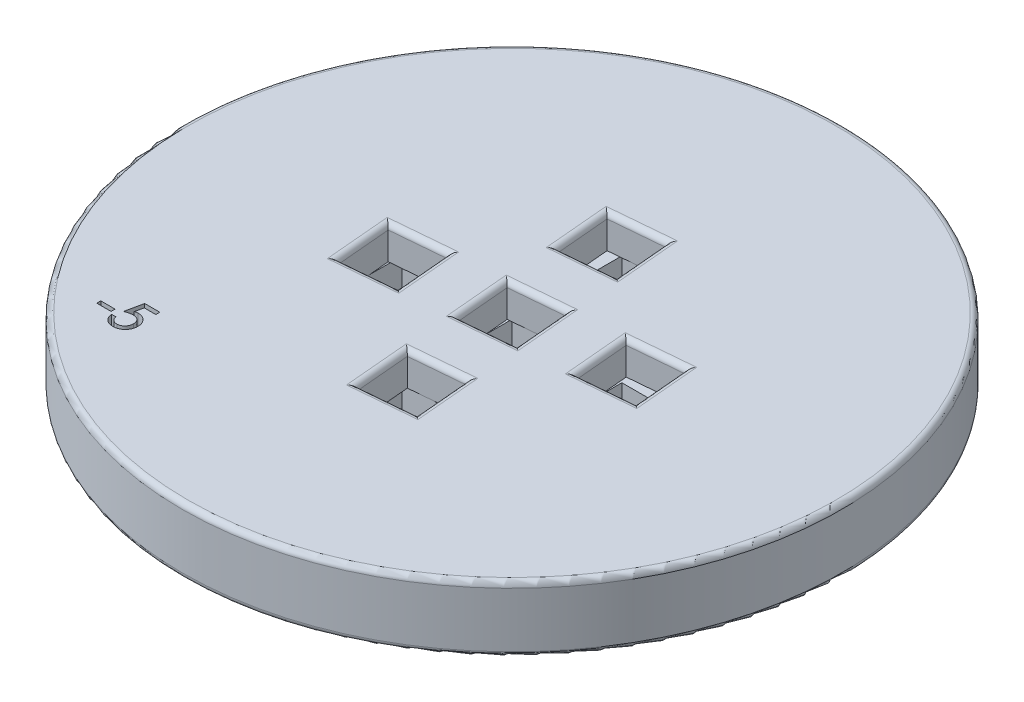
from build123d import *

# Parameters (mm, degrees)
SKETCH1_R           = 30
BOSS_EXTRUDE1_DEPTH = 6
SKETCH4_W           = 5
SKETCH4_H           = 5
CUT_EXTRUDE2_DEPTH  = 3
FILLET2_R           = 0.5
FILLET3_R           = 0.5
SKETCH6_W           = 1.302564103
SKETCH6_H           = 0.366346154
CUT_EXTRUDE3_DEPTH  = 3
FILLET5_R           = 0.5


with BuildPart() as part:
    # Sketch1 → Boss-Extrude1 (new body)
    with BuildSketch(Plane(origin=(0, 0, 0), x_dir=(1, 0, 0), z_dir=(0, 1, 0))):
        with Locations(Location((0, 0, 0), (0, 0, 270))):
            Circle(SKETCH1_R)
    extrude(amount=BOSS_EXTRUDE1_DEPTH)

    # Sketch4 → Cut-Extrude2 (cut)
    with BuildSketch(Plane(origin=(0, 0, 0), x_dir=(-1, 0, 0), z_dir=(0, -1, 0))):
        Rectangle(SKETCH4_W, SKETCH4_H)
        with Locations((0, -10)):
            Rectangle(SKETCH4_W, SKETCH4_H)
        with Locations((10, 0)):
            Rectangle(SKETCH4_W, SKETCH4_H)
        with Locations((-10, 0)):
            Rectangle(SKETCH4_W, SKETCH4_H)
        with Locations((0, 10)):
            Rectangle(SKETCH4_W, SKETCH4_H)
    extrude(amount=-CUT_EXTRUDE2_DEPTH, mode=Mode.SUBTRACT)

    # Fillet2
    fillet2_edges = [part.edges().sort_by_distance(p)[0] for p in [
        (0, 0, -30),
        (-2.5, 0, 10),
        (0, 0, 7.5),
        (2.5, 0, 10),
        (0, 0, 12.5),
        (-12.5, 0, 0),
        (-10, 0, -2.5),
        (-7.5, 0, 0),
        (-10, 0, 2.5),
        (7.5, 0, 0),
        (10, 0, -2.5),
        (12.5, 0, 0),
        (10, 0, 2.5),
        (2.5, 0, -10),
        (0, 0, -7.5),
        (-2.5, 0, -10),
        (0, 0, -12.5),
        (-2.5, 0, 0),
        (0, 0, -2.5),
        (2.5, 0, 0),
        (0, 0, 2.5),
    ]]
    fillet(fillet2_edges, radius=FILLET2_R)

    # Fillet3
    fillet3_edges = [part.edges().sort_by_distance(p)[0] for p in [
        (0, 6, -30),
    ]]
    fillet(fillet3_edges, radius=FILLET3_R)

    # Sketch6 → Cut-Extrude3 (cut)
    with BuildSketch(Plane(origin=(0, 6, 0), x_dir=(1, 0, 0), z_dir=(0, 1, 0))):
        Polygon((-2.272597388, -2.708376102), (2.708376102, -2.272597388), (2.272597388, 2.708376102), (-2.708376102, 2.272597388), align=None)
        Polygon((-3.144154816, 7.253570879), (1.836818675, 7.689349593), (1.401039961, 12.670323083), (-3.57993353, 12.234544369), align=None)
        Polygon((3.57993353, -12.234544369), (-1.401039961, -12.670323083), (-1.836818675, -7.689349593), (3.144154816, -7.253570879), align=None)
        Polygon((12.670323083, -1.401039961), (7.689349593, -1.836818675), (7.253570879, 3.144154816), (12.234544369, 3.57993353), align=None)
        Polygon((-12.234544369, -3.57993353), (-7.253570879, -3.144154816), (-7.689349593, 1.836818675), (-12.670323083, 1.401039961), align=None)
        with Locations((-19.019069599, -17.945677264)):
            Rectangle(SKETCH6_W, SKETCH6_H)
        with BuildLine():
            Line((-16.088300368, -15.971478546), (-16.088300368, -16.3378247))
            Line((-16.088300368, -16.3378247), (-17.131369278, -16.3378247))
            Line((-17.131369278, -16.3378247), (-17.301822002, -17.090233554))
            add(Edge.make_bspline(
                [(-17.301822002, -17.090233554), (-17.281936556, -17.080650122), (-17.241012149, -17.060927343), (-17.172592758, -17.043742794), (-17.098308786, -17.031651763), (-17.046413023, -17.030441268), (-17.019430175, -17.029811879)],
                knots=[0, 0, 0, 0, 0.906577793, 1.865744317, 2.890308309, 4, 4, 4, 4], degree=3))
            add(Edge.make_bspline(
                [(-17.019430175, -17.029811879), (-16.981214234, -17.030511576), (-16.906183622, -17.031885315), (-16.796832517, -17.047236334), (-16.692631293, -17.070234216), (-16.594437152, -17.104542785), (-16.501128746, -17.14677826), (-16.41371837, -17.19962982), (-16.332296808, -17.262200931), (-16.256972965, -17.333426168), (-16.188321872, -17.411007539), (-16.129359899, -17.494787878), (-16.078249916, -17.582319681), (-16.037737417, -17.675115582), (-16.005728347, -17.772215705), (-15.982964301, -17.874025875), (-15.968492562, -17.980241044), (-15.966961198, -18.052692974), (-15.966184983, -18.089417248)],
                knots=[0, 0, 0, 0, 1.094894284, 2.149641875, 3.159658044, 4.149576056, 5.125966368, 6.091225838, 7.071072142, 8.064343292, 9.05924964, 10.03573454, 10.996966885, 11.96032995, 12.932910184, 13.923798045, 14.947619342, 16, 16, 16, 16], degree=3))
            add(Edge.make_bspline(
                [(-15.966184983, -18.089417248), (-15.966781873, -18.11507932), (-15.967962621, -18.165843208), (-15.974115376, -18.241325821), (-15.985859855, -18.315180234), (-16.001453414, -18.387976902), (-16.022940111, -18.45909175), (-16.047399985, -18.529470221), (-16.077450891, -18.597990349), (-16.111758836, -18.664623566), (-16.149823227, -18.728882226), (-16.191733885, -18.78998682), (-16.237586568, -18.847448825), (-16.287543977, -18.900787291), (-16.340240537, -18.951374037), (-16.397050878, -18.997888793), (-16.457813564, -19.040526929), (-16.521661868, -19.079754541), (-16.588565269, -19.115193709), (-16.658916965, -19.144536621), (-16.73097043, -19.171197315), (-16.806507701, -19.191160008), (-16.884104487, -19.207957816), (-16.964692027, -19.219105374), (-17.047705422, -19.226373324), (-17.104004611, -19.227377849), (-17.132641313, -19.227888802)],
                knots=[0, 0, 0, 0, 1.012275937, 2.002451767, 2.98397589, 3.959820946, 4.936095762, 5.911940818, 6.896771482, 7.884012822, 8.866284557, 9.840372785, 10.804070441, 11.762530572, 12.720625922, 13.68308951, 14.655094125, 15.646011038, 16.637104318, 17.63729087, 18.650257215, 19.66446511, 20.715636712, 21.77986274, 22.870722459, 24, 24, 24, 24], degree=3))
            add(Edge.make_bspline(
                [(-17.132641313, -19.227888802), (-17.164894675, -19.22711447), (-17.228523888, -19.225586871), (-17.321976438, -19.21475197), (-17.411628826, -19.196368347), (-17.497101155, -19.170052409), (-17.57902934, -19.137044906), (-17.656714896, -19.096212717), (-17.730459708, -19.047922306), (-17.80035874, -18.99309428), (-17.864109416, -18.930550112), (-17.922873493, -18.863219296), (-17.972940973, -18.788622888), (-18.016985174, -18.708819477), (-18.054828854, -18.623159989), (-18.084935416, -18.531482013), (-18.109009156, -18.434132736), (-18.118631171, -18.366829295), (-18.123556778, -18.332375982)],
                knots=[0, 0, 0, 0, 1.049569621, 2.070583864, 3.057046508, 4.023914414, 4.977170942, 5.927726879, 6.875021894, 7.842677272, 8.813672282, 9.777581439, 10.74592533, 11.731059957, 12.74126976, 13.788569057, 14.867946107, 16, 16, 16, 16], degree=3))
            Line((-18.123556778, -18.332375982), (-17.72604576, -18.332375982))
            add(Edge.make_bspline(
                [(-17.72604576, -18.332375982), (-17.718480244, -18.365649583), (-17.704277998, -18.428111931), (-17.67376747, -18.513221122), (-17.641066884, -18.585607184), (-17.601071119, -18.644806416), (-17.555166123, -18.693399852), (-17.50421485, -18.73558035), (-17.448238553, -18.773417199), (-17.386614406, -18.804825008), (-17.32168653, -18.830270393), (-17.254224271, -18.848029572), (-17.185590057, -18.859196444), (-17.139254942, -18.860760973), (-17.116104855, -18.861542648)],
                knots=[0, 0, 0, 0, 1.385459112, 2.600831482, 3.66841355, 4.605180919, 5.48910649, 6.376050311, 7.288896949, 8.229144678, 9.181161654, 10.117453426, 11.059436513, 12, 12, 12, 12], degree=3))
            add(Edge.make_bspline(
                [(-17.116104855, -18.861542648), (-17.091061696, -18.860701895), (-17.04161869, -18.859041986), (-16.968781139, -18.849104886), (-16.899121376, -18.830723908), (-16.831633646, -18.806898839), (-16.76749675, -18.774448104), (-16.705136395, -18.736557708), (-16.646826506, -18.690029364), (-16.5909374, -18.638295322), (-16.539748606, -18.580991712), (-16.495175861, -18.519077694), (-16.457153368, -18.453796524), (-16.426852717, -18.384713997), (-16.402261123, -18.312463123), (-16.385357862, -18.236550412), (-16.374811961, -18.157134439), (-16.373768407, -18.103019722), (-16.373236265, -18.07542486)],
                knots=[0, 0, 0, 0, 0.99750234, 1.969380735, 2.919490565, 3.862219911, 4.813679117, 5.776605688, 6.762898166, 7.778387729, 8.806918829, 9.816812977, 10.811632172, 11.809420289, 12.815921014, 13.846113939, 14.901663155, 16, 16, 16, 16], degree=3))
            add(Edge.make_bspline(
                [(-16.373236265, -18.07542486), (-16.373868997, -18.050803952), (-16.37511142, -18.002458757), (-16.38421241, -17.931800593), (-16.398648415, -17.864401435), (-16.419625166, -17.800894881), (-16.446589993, -17.740929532), (-16.479748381, -17.684888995), (-16.518999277, -17.632461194), (-16.563140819, -17.583476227), (-16.613110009, -17.539707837), (-16.666762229, -17.500535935), (-16.725726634, -17.468854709), (-16.787876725, -17.441743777), (-16.854650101, -17.421930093), (-16.924850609, -17.405964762), (-16.999757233, -17.398294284), (-17.051006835, -17.396882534), (-17.077307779, -17.396158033)],
                knots=[0, 0, 0, 0, 1.071512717, 2.104004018, 3.095982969, 4.067795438, 5.009520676, 5.952827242, 6.895998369, 7.856350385, 8.817411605, 9.782937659, 10.74115891, 11.725120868, 12.729302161, 13.768330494, 14.854722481, 16, 16, 16, 16], degree=3))
            add(Edge.make_bspline(
                [(-17.077307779, -17.396158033), (-17.099798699, -17.396697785), (-17.14701607, -17.397830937), (-17.220902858, -17.406024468), (-17.301306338, -17.418911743), (-17.388099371, -17.436735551), (-17.481365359, -17.459956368), (-17.581217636, -17.488094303), (-17.687766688, -17.520927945), (-17.760462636, -17.546040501), (-17.797915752, -17.558978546)],
                knots=[0, 0, 0, 0, 0.727614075, 1.527550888, 2.402655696, 3.361819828, 4.39328773, 5.511706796, 6.718025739, 8, 8, 8, 8], degree=3))
            Line((-17.797915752, -17.558978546), (-17.464642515, -15.971478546))
            Line((-17.464642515, -15.971478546), (-16.088300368, -15.971478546))
        make_face()
    extrude(amount=-CUT_EXTRUDE3_DEPTH, mode=Mode.SUBTRACT)

    # Fillet5
    fillet5_edges = [part.edges().sort_by_distance(p)[0] for p in [
        (-2.490486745, 6, 0.217889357),
        (0.217889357, 6, 2.490486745),
        (2.490486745, 6, -0.217889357),
        (-0.217889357, 6, -2.490486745),
        (-3.362044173, 6, -9.744057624),
        (-0.653668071, 6, -7.471460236),
        (1.618929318, 6, -10.179836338),
        (-1.089446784, 6, -12.452433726),
        (3.362044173, 6, 9.744057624),
        (0.653668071, 6, 7.471460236),
        (-1.618929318, 6, 10.179836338),
        (1.089446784, 6, 12.452433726),
        (12.452433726, 6, -1.089446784),
        (9.744057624, 6, -3.362044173),
        (7.471460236, 6, -0.653668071),
        (10.179836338, 6, 1.618929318),
        (-12.452433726, 6, 1.089446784),
        (-9.744057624, 6, 3.362044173),
        (-7.471460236, 6, 0.653668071),
        (-10.179836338, 6, -1.618929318),
    ]]
    fillet(fillet5_edges, radius=FILLET5_R)


solid = part.part
